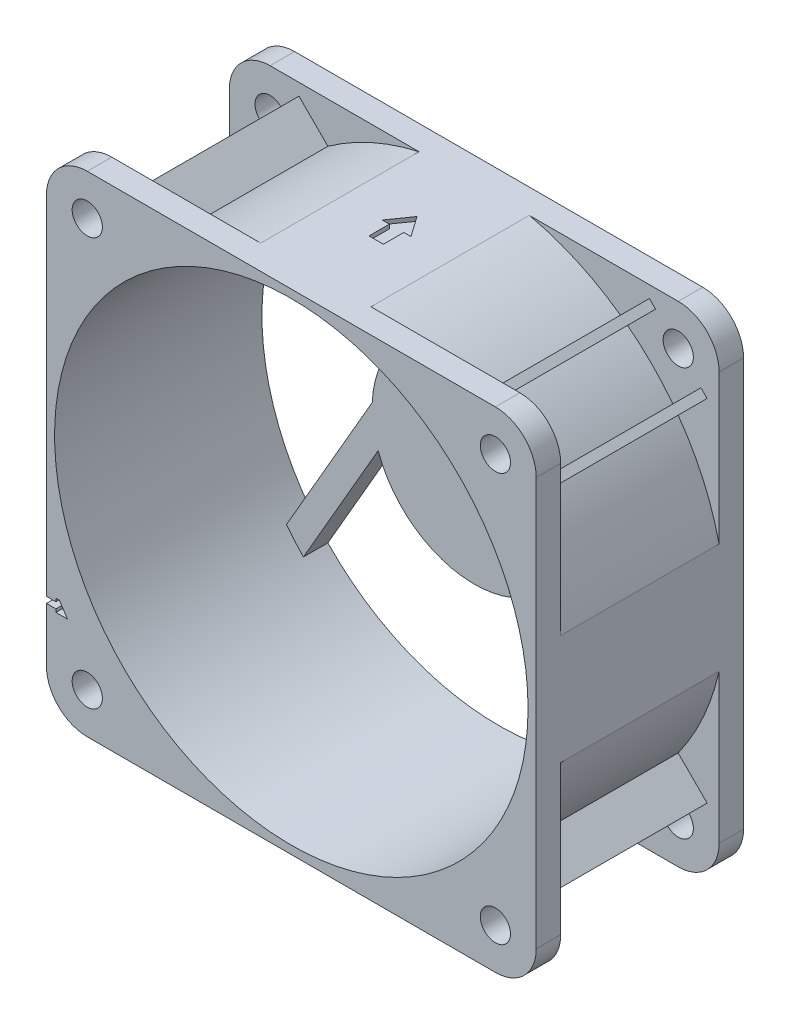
from build123d import *

# Parameters (mm, degrees)
SKETCH_BODY_R                       = 29
BODY_DEPTH                          = 25.4
SKETCH_CUT_BODY_W                   = 19.4
SKETCH_CUT_BODY_H                   = 9.605339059
REINFORCMENT_STRIP_REACH            = 51.449
CIRPATTERN_REINFORCMENT_STRIP_COUNT = 4
SKETCH_FIXING_HOLE_R                = 1.85
FIXING_HOLE_DEPTH                   = 50.44855913
CIRPATTERN_FIXING_HOLE_COUNT        = 4
BONE_DEPTH                          = 3
CIRPATTERN_BONE_COUNT               = 3
CUT_REINFORCMENT_STRIP_HOLE_REACH   = 51.449
SKETCH_FIXING_PLATE_FAN_R           = 12.5
FIXING_PLATE_FAN_DEPTH              = 3
AIR_EXHAUST_DEPTH                   = 72.312060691


with BuildPart() as part:
    # Sketch-Body → Body (new body)
    with BuildSketch(Plane.XY):
        with BuildLine():
            Line((-25, -30), (25, -30))
            ThreePointArc((25, -30), (28.535533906, -28.535533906), (30, -25))
            Line((30, -25), (30, 25))
            ThreePointArc((30, 25), (28.535533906, 28.535533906), (25, 30))
            Line((25, 30), (-25, 30))
            ThreePointArc((-25, 30), (-28.535533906, 28.535533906), (-30, 25))
            Line((-30, 25), (-30, -25))
            ThreePointArc((-30, -25), (-28.535533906, -28.535533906), (-25, -30))
        make_face()
        Circle(SKETCH_BODY_R, mode=Mode.SUBTRACT)
    extrude(amount=BODY_DEPTH)

    # Sketch-Cut-Body → Cut-Body (revolve, cut)
    with BuildSketch(Plane(origin=(0, 0, 0), x_dir=(0, 0, -1), z_dir=(1, 0, 0))):
        with Locations((-12.7, 35.55266953)):
            Rectangle(SKETCH_CUT_BODY_W, SKETCH_CUT_BODY_H)
    revolve(axis=Axis((0, 0, 25.4), (0, 0, -1)), mode=Mode.SUBTRACT)

    # Sketch-Reinforcment-Strip → Reinforcment-Strip (add, up to next)
    with BuildSketch(Plane.XY, mode=Mode.PRIVATE) as reinforcment_strip_sk1:
        with BuildLine():
            Line((24.452034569, 17.380966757), (28.535533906, 21.464466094))
            Line((28.535533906, 21.464466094), (27.779609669, 22.220390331))
            Line((27.779609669, 22.220390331), (23.809915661, 18.250696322))
            ThreePointArc((23.809915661, 18.250696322), (24.13489315, 17.818724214), (24.452034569, 17.380966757))
        make_face()
    reinforcment_strip_tool1 = extrude(reinforcment_strip_sk1.sketch, amount=REINFORCMENT_STRIP_REACH, mode=Mode.PRIVATE) - part.part
    # Sketch-Reinforcment-Strip → Reinforcment-Strip (add, up to next)
    with BuildSketch(Plane.XY, mode=Mode.PRIVATE) as reinforcment_strip_sk2:
        with BuildLine():
            Line((17.380966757, 24.452034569), (21.464466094, 28.535533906))
            Line((21.464466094, 28.535533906), (22.220390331, 27.779609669))
            Line((22.220390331, 27.779609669), (18.250696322, 23.809915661))
            ThreePointArc((18.250696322, 23.809915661), (17.818724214, 24.13489315), (17.380966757, 24.452034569))
        make_face()
    reinforcment_strip_tool2 = extrude(reinforcment_strip_sk2.sketch, amount=REINFORCMENT_STRIP_REACH, mode=Mode.PRIVATE) - part.part
    reinforcment_strip_1 = reinforcment_strip_tool1.solids().sort_by_distance((26.147081, 19.828375, 0))[0]
    add(reinforcment_strip_1)
    reinforcment_strip_2 = reinforcment_strip_tool2.solids().sort_by_distance((19.828375, 26.147081, 0))[0]
    add(reinforcment_strip_2)
    reinforcment_strip = reinforcment_strip_1 + reinforcment_strip_2  # Reinforcment-Strip as one shape, for the pattern or mirror that repeats it

    # CirPattern-Reinforcment-Strip: Reinforcment-Strip ×4 about axis
    cirpattern_reinforcment_strip_axis = Axis((0, 0, 0), (0, 0, 1))
    for i in range(1, CIRPATTERN_REINFORCMENT_STRIP_COUNT):
        add(reinforcment_strip.rotate(cirpattern_reinforcment_strip_axis, i * 360 / CIRPATTERN_REINFORCMENT_STRIP_COUNT))

    # Sketch-Fixing-Hole → Fixing-Hole (cut, through all)
    with BuildSketch(Plane.XY):
        with Locations(Location((25, 25, 0), (0, 0, 90))):
            Circle(SKETCH_FIXING_HOLE_R)
    fixing_hole = extrude(amount=FIXING_HOLE_DEPTH, mode=Mode.SUBTRACT)

    # CirPattern-Fixing-Hole: Fixing-Hole ×4 about axis
    cirpattern_fixing_hole_axis = Axis((0, 0, 0), (0, 0, 1))
    for i in range(1, CIRPATTERN_FIXING_HOLE_COUNT):
        add(fixing_hole.rotate(cirpattern_fixing_hole_axis, i * 360 / CIRPATTERN_FIXING_HOLE_COUNT), mode=Mode.SUBTRACT)

    # Sketch-Bone → Bone (add)
    with BuildSketch(Plane.XY):
        with BuildLine():
            Line((-11.764259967, -4.225184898), (-20.920098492, -20.08356241))
            ThreePointArc((-20.920098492, -20.08356241), (-21.989386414, -18.906794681), (-22.992571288, -17.673190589))
            Line((-22.992571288, -17.673190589), (-12.489214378, 0.519157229))
            ThreePointArc((-12.489214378, 0.519157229), (-12.356575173, -1.888133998), (-11.764259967, -4.225184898))
        make_face()
    bone = extrude(amount=BONE_DEPTH)

    # CirPattern-Bone: Bone ×3 about axis
    cirpattern_bone_axis = Axis((0, 0, 0), (0, 0, 1))
    for i in range(1, CIRPATTERN_BONE_COUNT):
        add(bone.rotate(cirpattern_bone_axis, i * 360 / CIRPATTERN_BONE_COUNT))

    # Sketch1 → Cut-Reinforcment-Strip-Hole (cut, up to next)
    with BuildSketch(Plane.XY.offset(25.4), mode=Mode.PRIVATE) as cut_reinforcment_strip_hole_sk1:
        with BuildLine():
            Line((-27.430592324, -18.724638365), (-28.841857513, -18.724638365))
            Line((-28.841857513, -18.724638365), (-28.841857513, -18.34833506))
            Line((-28.841857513, -18.34833506), (-30, -18.34833506))
            Line((-30, -18.34833506), (-30, -17.59572845))
            Line((-30, -17.59572845), (-28.841857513, -17.59572845))
            Line((-28.841857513, -17.59572845), (-28.841857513, -17.219425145))
            Line((-28.841857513, -17.219425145), (-28.399663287, -17.219425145))
            ThreePointArc((-28.399663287, -17.219425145), (-27.925271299, -17.978562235), (-27.430592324, -18.724638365))
        make_face()
    cut_reinforcment_strip_hole_tool1 = extrude(cut_reinforcment_strip_hole_sk1.sketch, amount=-CUT_REINFORCMENT_STRIP_HOLE_REACH, mode=Mode.PRIVATE) & part.part
    add(cut_reinforcment_strip_hole_tool1.solids().sort_by_distance((-28.75872, -18.053256, 25.4))[0], mode=Mode.SUBTRACT)

    # Sketch-Fixing-Plate-Fan → Fixing-Plate-Fan (add)
    with BuildSketch(Plane.XY):
        Circle(SKETCH_FIXING_PLATE_FAN_R)
    extrude(amount=FIXING_PLATE_FAN_DEPTH)

    # Sketch4 → Air-Exhaust (cut, through all)
    with BuildSketch(Plane(origin=(0, 29.5, 0), x_dir=(-1, 0, 0), z_dir=(0, 1, 0))):
        Polygon((0.881634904, 15), (-0.881634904, 15), (-0.881634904, 12.5), (-1.750518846, 12.5), (0, 10), (1.750518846, 12.5), (0.881634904, 12.5), align=None)
    extrude(amount=AIR_EXHAUST_DEPTH, mode=Mode.SUBTRACT)


solid = part.part
